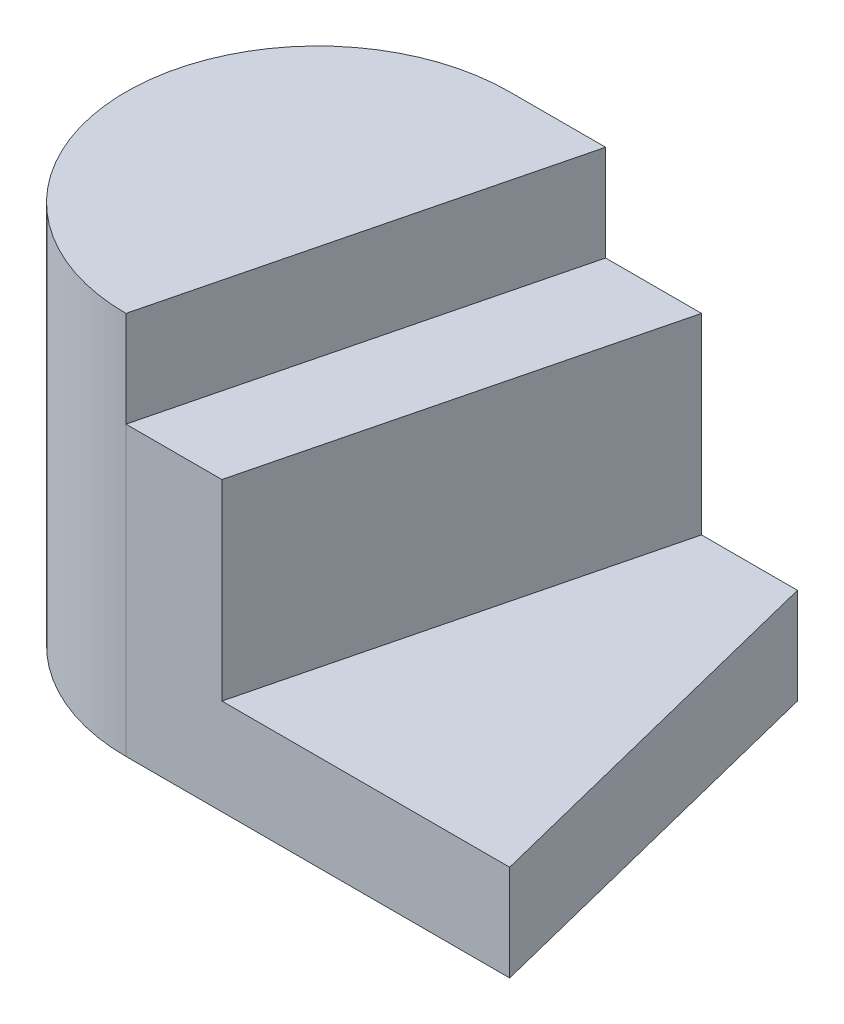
from build123d import *

# Parameters (mm, degrees)
EXTRUDE1_DEPTH = 40
EXTRUDE2_DEPTH = 30
EXTRUDE3_DEPTH = 10


with BuildPart() as part:
    # Sketch1 → Extrude1 (new body)
    with BuildSketch(Plane(origin=(0, 0, 0), x_dir=(1, 0, 0), z_dir=(0, 1, 0))):
        with BuildLine():
            Line((10, 20), (0, 20))
            ThreePointArc((0, 20), (-20, 0), (0, -20))
            Line((0, -20), (10, 20))
        make_face()
    extrude(amount=EXTRUDE1_DEPTH)

    # Sketch → Extrude2 (add)
    with BuildSketch(Plane(origin=(0, 0, 0), x_dir=(1, 0, 0), z_dir=(0, 1, 0))):
        Polygon((20, 20), (10, 20), (0, -20), (10, -20), align=None)
    extrude(amount=EXTRUDE2_DEPTH)

    # Sketch 2 → Extrude3 (add)
    with BuildSketch(Plane(origin=(0, 0, 0), x_dir=(1, 0, 0), z_dir=(0, 1, 0))):
        Polygon((30, 20), (20, 20), (10, -20), (40, -20), align=None)
    extrude(amount=EXTRUDE3_DEPTH)


solid = part.part
